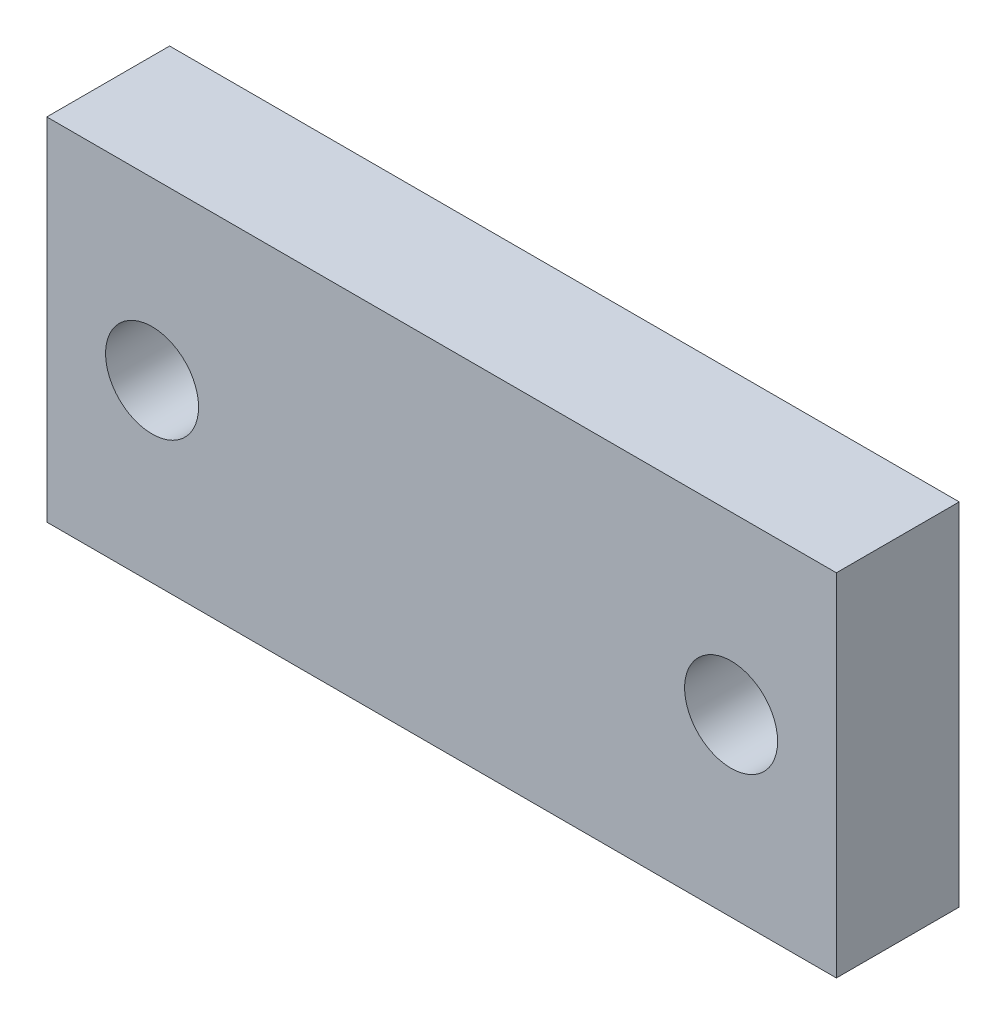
ISO-10303-21;
HEADER;
FILE_DESCRIPTION(('STEP AP214'),'2;1');
FILE_NAME('part.step','',(''),(''),'','','');
FILE_SCHEMA(('AUTOMOTIVE_DESIGN { 1 0 10303 214 1 1 1 1 }'));
ENDSEC;
DATA;
#1=APPLICATION_CONTEXT('core data for automotive mechanical design processes');
#2=APPLICATION_PROTOCOL_DEFINITION('international standard','automotive_design',2000,#1);
#3=PRODUCT_CONTEXT('',#1,'mechanical');
#4=PRODUCT('Part','Part','',(#3));
#5=PRODUCT_RELATED_PRODUCT_CATEGORY('part','',(#4));
#6=PRODUCT_DEFINITION_FORMATION('','',#4);
#7=PRODUCT_DEFINITION_CONTEXT('part definition',#1,'design');
#8=PRODUCT_DEFINITION('design','',#6,#7);
#9=PRODUCT_DEFINITION_SHAPE('','',#8);
#10=(LENGTH_UNIT() NAMED_UNIT(*) SI_UNIT(.MILLI.,.METRE.));
#11=(NAMED_UNIT(*) PLANE_ANGLE_UNIT() SI_UNIT($,.RADIAN.));
#12=(NAMED_UNIT(*) SI_UNIT($,.STERADIAN.) SOLID_ANGLE_UNIT());
#13=UNCERTAINTY_MEASURE_WITH_UNIT(LENGTH_MEASURE(1.E-05),#10,'distance_accuracy_value','');
#14=(GEOMETRIC_REPRESENTATION_CONTEXT(3) GLOBAL_UNCERTAINTY_ASSIGNED_CONTEXT((#13)) GLOBAL_UNIT_ASSIGNED_CONTEXT((#10,
#11,#12)) REPRESENTATION_CONTEXT('',''));
#15=CARTESIAN_POINT('',(0.,0.,0.));
#16=DIRECTION('',(0.,0.,1.));
#17=DIRECTION('',(1.,0.,0.));
#18=AXIS2_PLACEMENT_3D('',#15,#16,#17);
#19=CARTESIAN_POINT('',(0.,0.,7.));
#20=DIRECTION('',(1.,0.,0.));
#21=DIRECTION('',(0.,1.,0.));
#22=AXIS2_PLACEMENT_3D('',#19,#20,#21);
#23=PLANE('',#22);
#24=DIRECTION('',(0.,-1.,0.));
#25=VECTOR('',#24,1.);
#26=CARTESIAN_POINT('',(0.,0.,0.));
#27=LINE('',#26,#25);
#28=CARTESIAN_POINT('',(0.,0.,0.));
#29=VERTEX_POINT('',#28);
#30=CARTESIAN_POINT('',(0.,-20.,0.));
#31=VERTEX_POINT('',#30);
#32=EDGE_CURVE('E96',#29,#31,#27,.T.);
#33=ORIENTED_EDGE('',*,*,#32,.T.);
#34=DIRECTION('',(0.,0.,-1.));
#35=VECTOR('',#34,1.);
#36=CARTESIAN_POINT('',(0.,-20.,7.));
#37=LINE('',#36,#35);
#38=CARTESIAN_POINT('',(0.,-20.,7.));
#39=VERTEX_POINT('',#38);
#40=EDGE_CURVE('E11',#39,#31,#37,.T.);
#41=ORIENTED_EDGE('',*,*,#40,.F.);
#42=DIRECTION('',(0.,-1.,0.));
#43=VECTOR('',#42,1.);
#44=CARTESIAN_POINT('',(0.,0.,7.));
#45=LINE('',#44,#43);
#46=CARTESIAN_POINT('',(0.,0.,7.));
#47=VERTEX_POINT('',#46);
#48=EDGE_CURVE('E84',#47,#39,#45,.T.);
#49=ORIENTED_EDGE('',*,*,#48,.F.);
#50=DIRECTION('',(0.,0.,-1.));
#51=VECTOR('',#50,1.);
#52=CARTESIAN_POINT('',(0.,0.,7.));
#53=LINE('',#52,#51);
#54=EDGE_CURVE('E92',#47,#29,#53,.T.);
#55=ORIENTED_EDGE('',*,*,#54,.T.);
#56=EDGE_LOOP('',(#33,#41,#49,#55));
#57=FACE_BOUND('',#56,.T.);
#58=ADVANCED_FACE('F33',(#57),#23,.F.);
#59=CARTESIAN_POINT('',(0.,-20.,7.));
#60=DIRECTION('',(0.,1.,0.));
#61=DIRECTION('',(0.,0.,1.));
#62=AXIS2_PLACEMENT_3D('',#59,#60,#61);
#63=PLANE('',#62);
#64=DIRECTION('',(1.,0.,0.));
#65=VECTOR('',#64,1.);
#66=CARTESIAN_POINT('',(0.,-20.,0.));
#67=LINE('',#66,#65);
#68=CARTESIAN_POINT('',(45.,-20.,0.));
#69=VERTEX_POINT('',#68);
#70=EDGE_CURVE('E88',#31,#69,#67,.T.);
#71=ORIENTED_EDGE('',*,*,#70,.T.);
#72=DIRECTION('',(0.,0.,-1.));
#73=VECTOR('',#72,1.);
#74=CARTESIAN_POINT('',(45.,-20.,7.));
#75=LINE('',#74,#73);
#76=CARTESIAN_POINT('',(45.,-20.,7.));
#77=VERTEX_POINT('',#76);
#78=EDGE_CURVE('E41',#77,#69,#75,.T.);
#79=ORIENTED_EDGE('',*,*,#78,.F.);
#80=DIRECTION('',(1.,0.,0.));
#81=VECTOR('',#80,1.);
#82=CARTESIAN_POINT('',(0.,-20.,7.));
#83=LINE('',#82,#81);
#84=EDGE_CURVE('E79',#39,#77,#83,.T.);
#85=ORIENTED_EDGE('',*,*,#84,.F.);
#86=ORIENTED_EDGE('',*,*,#40,.T.);
#87=EDGE_LOOP('',(#71,#79,#85,#86));
#88=FACE_BOUND('',#87,.T.);
#89=ADVANCED_FACE('F87',(#88),#63,.F.);
#90=CARTESIAN_POINT('',(45.,0.,7.));
#91=DIRECTION('',(-1.,0.,0.));
#92=DIRECTION('',(0.,-1.,0.));
#93=AXIS2_PLACEMENT_3D('',#90,#91,#92);
#94=PLANE('',#93);
#95=DIRECTION('',(0.,1.,0.));
#96=VECTOR('',#95,1.);
#97=CARTESIAN_POINT('',(45.,0.,0.));
#98=LINE('',#97,#96);
#99=CARTESIAN_POINT('',(45.,0.,0.));
#100=VERTEX_POINT('',#99);
#101=EDGE_CURVE('E66',#69,#100,#98,.T.);
#102=ORIENTED_EDGE('',*,*,#101,.T.);
#103=DIRECTION('',(0.,0.,-1.));
#104=VECTOR('',#103,1.);
#105=CARTESIAN_POINT('',(45.,0.,7.));
#106=LINE('',#105,#104);
#107=CARTESIAN_POINT('',(45.,0.,7.));
#108=VERTEX_POINT('',#107);
#109=EDGE_CURVE('E89',#108,#100,#106,.T.);
#110=ORIENTED_EDGE('',*,*,#109,.F.);
#111=DIRECTION('',(0.,1.,0.));
#112=VECTOR('',#111,1.);
#113=CARTESIAN_POINT('',(45.,0.,7.));
#114=LINE('',#113,#112);
#115=EDGE_CURVE('E82',#77,#108,#114,.T.);
#116=ORIENTED_EDGE('',*,*,#115,.F.);
#117=ORIENTED_EDGE('',*,*,#78,.T.);
#118=EDGE_LOOP('',(#102,#110,#116,#117));
#119=FACE_BOUND('',#118,.T.);
#120=ADVANCED_FACE('F90',(#119),#94,.F.);
#121=CARTESIAN_POINT('',(0.,0.,7.));
#122=DIRECTION('',(0.,-1.,0.));
#123=DIRECTION('',(0.,0.,-1.));
#124=AXIS2_PLACEMENT_3D('',#121,#122,#123);
#125=PLANE('',#124);
#126=DIRECTION('',(-1.,0.,0.));
#127=VECTOR('',#126,1.);
#128=CARTESIAN_POINT('',(0.,0.,0.));
#129=LINE('',#128,#127);
#130=EDGE_CURVE('E72',#100,#29,#129,.T.);
#131=ORIENTED_EDGE('',*,*,#130,.T.);
#132=ORIENTED_EDGE('',*,*,#54,.F.);
#133=DIRECTION('',(-1.,0.,0.));
#134=VECTOR('',#133,1.);
#135=CARTESIAN_POINT('',(0.,0.,7.));
#136=LINE('',#135,#134);
#137=EDGE_CURVE('E49',#108,#47,#136,.T.);
#138=ORIENTED_EDGE('',*,*,#137,.F.);
#139=ORIENTED_EDGE('',*,*,#109,.T.);
#140=EDGE_LOOP('',(#131,#132,#138,#139));
#141=FACE_BOUND('',#140,.T.);
#142=ADVANCED_FACE('F104',(#141),#125,.F.);
#143=CARTESIAN_POINT('',(0.,0.,7.));
#144=DIRECTION('',(0.,0.,1.));
#145=DIRECTION('',(1.,0.,0.));
#146=AXIS2_PLACEMENT_3D('',#143,#144,#145);
#147=PLANE('',#146);
#148=CARTESIAN_POINT('',(6.,-10.,7.));
#149=DIRECTION('',(0.,0.,1.));
#150=DIRECTION('',(1.,0.,0.));
#151=AXIS2_PLACEMENT_3D('',#148,#149,#150);
#152=CIRCLE('',#151,2.65);
#153=CARTESIAN_POINT('',(8.65,-10.,7.));
#154=VERTEX_POINT('',#153);
#155=EDGE_CURVE('E116',#154,#154,#152,.T.);
#156=ORIENTED_EDGE('',*,*,#155,.F.);
#157=EDGE_LOOP('',(#156));
#158=FACE_BOUND('',#157,.T.);
#159=CARTESIAN_POINT('',(39.,-10.,7.));
#160=DIRECTION('',(0.,0.,1.));
#161=DIRECTION('',(1.,0.,0.));
#162=AXIS2_PLACEMENT_3D('',#159,#160,#161);
#163=CIRCLE('',#162,2.65);
#164=CARTESIAN_POINT('',(41.65,-10.,7.));
#165=VERTEX_POINT('',#164);
#166=EDGE_CURVE('E110',#165,#165,#163,.T.);
#167=ORIENTED_EDGE('',*,*,#166,.F.);
#168=EDGE_LOOP('',(#167));
#169=FACE_BOUND('',#168,.T.);
#170=ORIENTED_EDGE('',*,*,#48,.T.);
#171=ORIENTED_EDGE('',*,*,#84,.T.);
#172=ORIENTED_EDGE('',*,*,#115,.T.);
#173=ORIENTED_EDGE('',*,*,#137,.T.);
#174=EDGE_LOOP('',(#170,#171,#172,#173));
#175=FACE_BOUND('',#174,.T.);
#176=ADVANCED_FACE('F80',(#158,#169,#175),#147,.T.);
#177=CARTESIAN_POINT('',(0.,0.,0.));
#178=DIRECTION('',(0.,0.,1.));
#179=DIRECTION('',(1.,0.,0.));
#180=AXIS2_PLACEMENT_3D('',#177,#178,#179);
#181=PLANE('',#180);
#182=CARTESIAN_POINT('',(6.,-10.,0.));
#183=DIRECTION('',(0.,0.,1.));
#184=DIRECTION('',(1.,0.,0.));
#185=AXIS2_PLACEMENT_3D('',#182,#183,#184);
#186=CIRCLE('',#185,2.65);
#187=CARTESIAN_POINT('',(8.65,-10.,0.));
#188=VERTEX_POINT('',#187);
#189=EDGE_CURVE('E99',#188,#188,#186,.T.);
#190=ORIENTED_EDGE('',*,*,#189,.T.);
#191=EDGE_LOOP('',(#190));
#192=FACE_BOUND('',#191,.T.);
#193=CARTESIAN_POINT('',(39.,-10.,0.));
#194=DIRECTION('',(0.,0.,1.));
#195=DIRECTION('',(1.,0.,0.));
#196=AXIS2_PLACEMENT_3D('',#193,#194,#195);
#197=CIRCLE('',#196,2.65);
#198=CARTESIAN_POINT('',(41.65,-10.,0.));
#199=VERTEX_POINT('',#198);
#200=EDGE_CURVE('E113',#199,#199,#197,.T.);
#201=ORIENTED_EDGE('',*,*,#200,.T.);
#202=EDGE_LOOP('',(#201));
#203=FACE_BOUND('',#202,.T.);
#204=ORIENTED_EDGE('',*,*,#32,.F.);
#205=ORIENTED_EDGE('',*,*,#130,.F.);
#206=ORIENTED_EDGE('',*,*,#101,.F.);
#207=ORIENTED_EDGE('',*,*,#70,.F.);
#208=EDGE_LOOP('',(#204,#205,#206,#207));
#209=FACE_BOUND('',#208,.T.);
#210=ADVANCED_FACE('F107',(#192,#203,#209),#181,.F.);
#211=CARTESIAN_POINT('',(39.,-10.,0.));
#212=DIRECTION('',(0.,0.,1.));
#213=DIRECTION('',(1.,0.,0.));
#214=AXIS2_PLACEMENT_3D('',#211,#212,#213);
#215=CYLINDRICAL_SURFACE('',#214,2.65);
#216=ORIENTED_EDGE('',*,*,#200,.F.);
#217=EDGE_LOOP('',(#216));
#218=FACE_BOUND('',#217,.T.);
#219=ORIENTED_EDGE('',*,*,#166,.T.);
#220=EDGE_LOOP('',(#219));
#221=FACE_BOUND('',#220,.T.);
#222=ADVANCED_FACE('F127',(#218,#221),#215,.F.);
#223=CARTESIAN_POINT('',(6.,-10.,0.));
#224=DIRECTION('',(0.,0.,1.));
#225=DIRECTION('',(1.,0.,0.));
#226=AXIS2_PLACEMENT_3D('',#223,#224,#225);
#227=CYLINDRICAL_SURFACE('',#226,2.65);
#228=ORIENTED_EDGE('',*,*,#189,.F.);
#229=EDGE_LOOP('',(#228));
#230=FACE_BOUND('',#229,.T.);
#231=ORIENTED_EDGE('',*,*,#155,.T.);
#232=EDGE_LOOP('',(#231));
#233=FACE_BOUND('',#232,.T.);
#234=ADVANCED_FACE('F124',(#230,#233),#227,.F.);
#235=CLOSED_SHELL('',(#58,#89,#120,#142,#176,#210,#222,#234));
#236=MANIFOLD_SOLID_BREP('B2',#235);
#237=ADVANCED_BREP_SHAPE_REPRESENTATION('',(#18,#236),#14);
#238=SHAPE_DEFINITION_REPRESENTATION(#9,#237);
ENDSEC;
END-ISO-10303-21;
